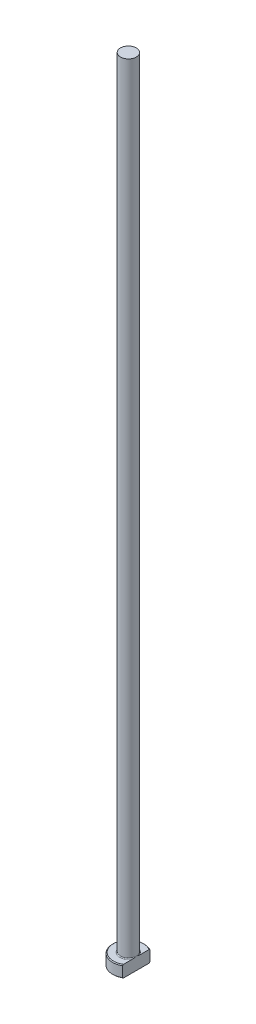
from build123d import *
from build123d.topology import SkipClean

# Parameters (mm, degrees)
CHAMFER1_SIZE = 0.2
FILLET1_R     = 0.2
KEY_DEPTH     = 201.079984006


with BuildPart() as part:
    # Sketch1 → Revolve1 (revolve)
    with BuildSketch(Plane.XY, mode=Mode.PRIVATE) as revolve1_sk:
        Polygon((0, 0), (-4, 0), (-4, 3), (-2, 3), (-2, 200), (0, 200), align=None)
    revolve(revolve1_sk.sketch.rotate(Axis((0, 259.958771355, 0), (0, -1, 0)), 270), axis=Axis((0, 259.958771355, 0), (0, -1, 0)))

    # Chamfer1
    chamfer1_edges = [part.edges().sort_by_distance(p)[0] for p in [
        (0, 3, -4),
        (0, 0, -4),
    ]]
    chamfer(chamfer1_edges, length=CHAMFER1_SIZE)

    # Fillet1
    fillet1_edges = [part.edges().sort_by_distance(p)[0] for p in [
        (0, 3, -2),
    ]]
    fillet(fillet1_edges, radius=FILLET1_R)

    # Sketch2 → KEY (cut, through all)
    with SkipClean():  # the faces are left unmerged after this step: merging them gives an invalid solid
        with BuildSketch(Plane(origin=(0, 0, 0), x_dir=(1, 0, 0), z_dir=(0, 1, 0))):
            with BuildLine():
                Line((2, 3.464101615), (2, -3.464101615))
                ThreePointArc((2, -3.464101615), (4, 0), (2, 3.464101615))
            make_face()
        extrude(amount=KEY_DEPTH, mode=Mode.SUBTRACT)


solid = part.part
